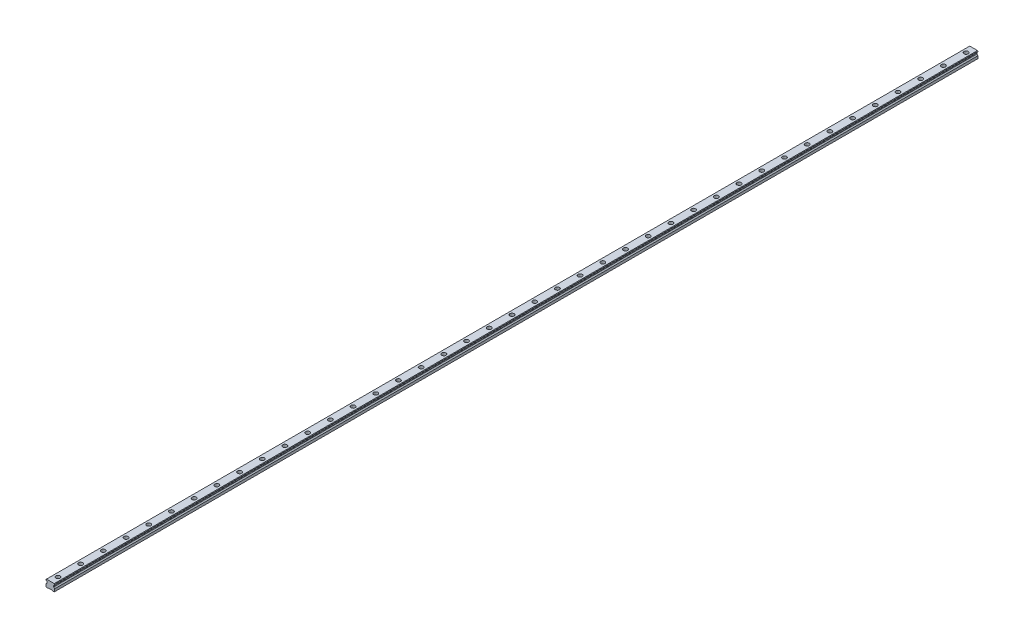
from build123d import *

# Parameters (mm, degrees)
SKETCH1_W           = 23
SKETCH1_H           = 19.2
BOSS_EXTRUDE1_DEPTH = 1220
CUT_EXTRUDE1_DEPTH  = 2441.102639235
CHAMFER1_SIZE       = 1.25
FILLET1_R           = 1.25
CUT_EXTRUDE2_DEPTH  = 2441.102639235
SKETCH4_R           = 5.5
SKETCH4_R_2         = 3.5
CUT_EXTRUDE3_DEPTH  = 9
SKETCH4_2_R         = 3.5
CUT_EXTRUDE4_DEPTH  = 1221.205265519
LPATTERN1_COUNT     = 41
LPATTERN1_PITCH     = 60


with BuildPart() as part:
    # Sketch1 → Boss-Extrude1 (new, symmetric)
    with BuildSketch(Plane.XY):
        with Locations((0, 9.6)):
            Rectangle(SKETCH1_W, SKETCH1_H)
    extrude(amount=BOSS_EXTRUDE1_DEPTH, both=True)

    # Sketch2 → Cut-Extrude1 (cut, through all)
    with BuildSketch(Plane.XY.offset(1220)):
        Polygon((-11.5, 16.7), (-11.5, 7.95), (-8.583333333, 10.866666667), (-8.583333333, 13.783333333), align=None)
        Polygon((8.583333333, 13.783333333), (11.5, 16.7), (11.5, 7.95), (8.583333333, 10.866666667), align=None)
    extrude(amount=-CUT_EXTRUDE1_DEPTH, mode=Mode.SUBTRACT)

    # Chamfer1
    chamfer1_edges = [part.edges().sort_by_distance(p)[0] for p in [
        (-11.5, 19.2, 0),
        (11.5, 19.2, 0),
        (11.5, 0, 0),
        (-11.5, 0, 0),
    ]]
    chamfer(chamfer1_edges, length=CHAMFER1_SIZE)

    # Fillet1
    fillet1_edges = [part.edges().sort_by_distance(p)[0] for p in [
        (-8.583333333, 13.783333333, 0),
        (-8.583333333, 10.866666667, 0),
        (8.583333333, 10.866666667, 0),
        (8.583333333, 13.783333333, 0),
    ]]
    fillet(fillet1_edges, radius=FILLET1_R)

    # Sketch3 → Cut-Extrude2 (cut, through all)
    with BuildSketch(Plane.XY.offset(1220)):
        Polygon((-7, 0), (-5.75, 1.25), (5.75, 1.25), (7, 0), align=None)
    extrude(amount=-CUT_EXTRUDE2_DEPTH, mode=Mode.SUBTRACT)

    # Sketch4 → Cut-Extrude3 (cut)
    with BuildSketch(Plane(origin=(0, 19.2, 0), x_dir=(1, 0, 0), z_dir=(0, 1, 0))):
        with Locations(Location((0, -1200, 0), (0, 0, 270))):
            Circle(SKETCH4_R)
        with Locations(Location((0, -1200, 0), (0, 0, 270))):
            Circle(SKETCH4_R_2, mode=Mode.SUBTRACT)
    cut_extrude3 = extrude(amount=-CUT_EXTRUDE3_DEPTH, mode=Mode.SUBTRACT)

    # Sketch4_2 → Cut-Extrude4 (cut, through all)
    with BuildSketch(Plane(origin=(0, 19.2, 0), x_dir=(1, 0, 0), z_dir=(0, 1, 0))):
        with Locations(Location((0, -1200, 0), (0, 0, 270))):
            Circle(SKETCH4_2_R)
    cut_extrude4 = extrude(amount=-CUT_EXTRUDE4_DEPTH, mode=Mode.SUBTRACT)

    # LPattern1: Cut-Extrude3, Cut-Extrude4 ×41
    with Locations(*[(0, 0, -i * LPATTERN1_PITCH) for i in range(1, LPATTERN1_COUNT)]):
        add(cut_extrude3, mode=Mode.SUBTRACT)
        add(cut_extrude4, mode=Mode.SUBTRACT)


solid = part.part
